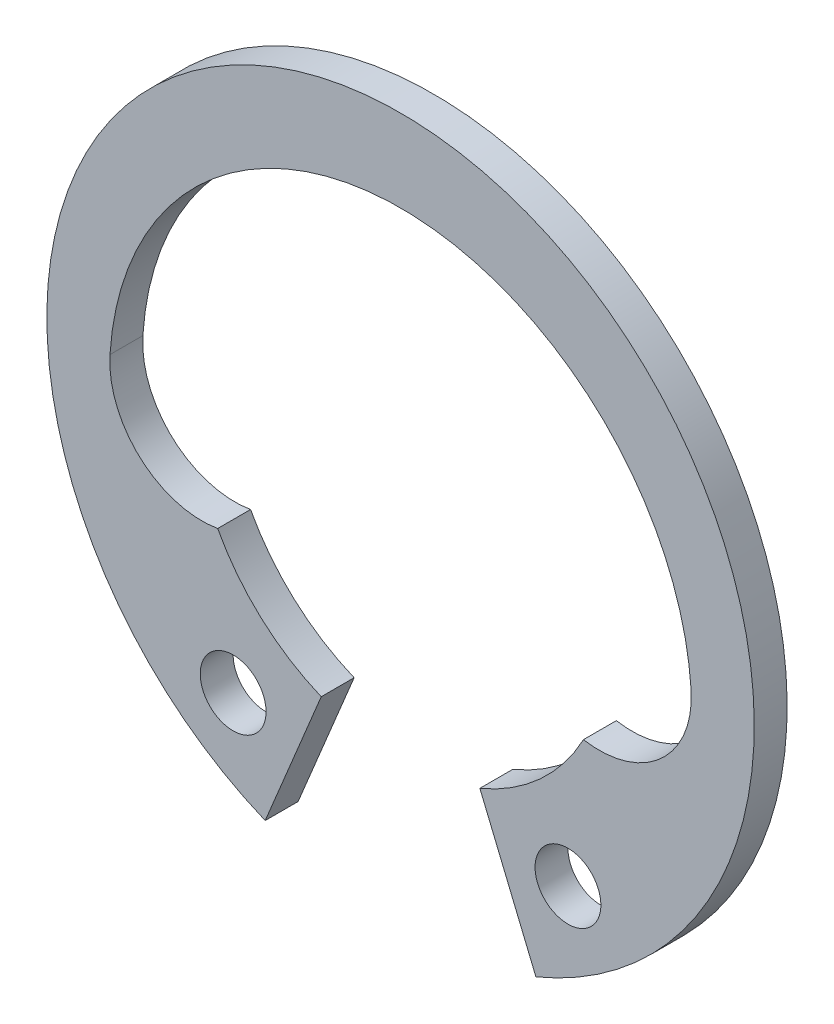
from build123d import *

# Parameters (mm, degrees)
SKETCH1_R  = 1
BODY_DEPTH = 1


with BuildPart() as part:
    # Sketch1 → Body (new body)
    with BuildSketch(Plane.XY):
        with BuildLine():
            Line((-2.410905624, -5.820441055), (-4.113846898, -9.931704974))
            ThreePointArc((-4.113846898, -9.931704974), (0, 10.75), (4.113846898, -9.931704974))
            Line((4.113846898, -9.931704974), (2.410905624, -5.820441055))
            ThreePointArc((2.410905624, -5.820441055), (4.232413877, -4.666548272), (5.558129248, -2.966007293))
            ThreePointArc((5.558129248, -2.966007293), (7.908430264, -2.290246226), (8.83133721, -0.025558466))
            ThreePointArc((8.83133721, -0.025558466), (0, 8.25), (-8.83133721, -0.025558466))
            ThreePointArc((-8.83133721, -0.025558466), (-7.908430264, -2.290246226), (-5.558129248, -2.966007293))
            ThreePointArc((-5.558129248, -2.966007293), (-4.232413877, -4.666548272), (-2.410905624, -5.820441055))
        make_face()
        with Locations(Location((5.087937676, -7.057116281, 0), (0, 0, 180))):
            Circle(SKETCH1_R, mode=Mode.SUBTRACT)
        with Locations((-5.087937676, -7.057116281)):
            Circle(SKETCH1_R, mode=Mode.SUBTRACT)
    extrude(amount=-BODY_DEPTH)


solid = part.part
